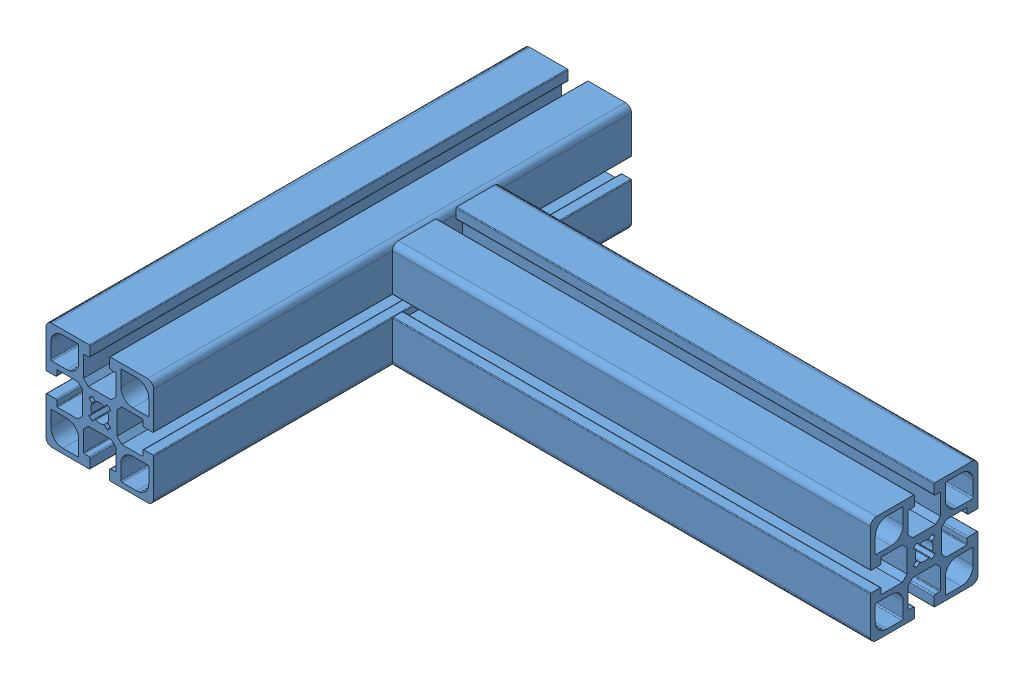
SolidWorks assembly Baugruppe.SLDASM, configuration Standard (file format 6000). Lengths in mm.
Overall size (245 45 200).
2 component instances, 1 part files, 3 mates.
Components (placement in the parent):
- 20.1033_0 Profil 45x45 F-1: 20.1033_0 Profil 45x45 F.SLDPRT [20.1033_0 Profil 45x45 F L=200mm] at origin size (45 45 200)
- 20.1033_0 Profil 45x45 F-2: 20.1033_0 Profil 45x45 F.SLDPRT [20.1033_0 Profil 45x45 F L=200mm] at (122.5 0 -22.5) x (0 0 1) z (-1 0 0) size (45 45 200)
Mates (geometry in assembly coordinates):
- Deckungsgleich1: coincident anti-aligned: plane of 20.1033_0 Profil 45x45 F-1 through (22.5 -20 100) normal (1 0 0); plane of 20.1033_0 Profil 45x45 F-2 through (22.5 -4.4 -44.7) normal (-1 0 0)
- Abstand1: distance = 100 mm aligned: plane of 20.1033_0 Profil 45x45 F-2 through (22.5 4.4 0) normal (0 0 1); plane of 20.1033_0 Profil 45x45 F-1 through (-22.2 -4.4 100) normal (0 0 1)
- Deckungsgleich4: coincident aligned: plane of 20.1033_0 Profil 45x45 F-1 through (4.4 22.5 100) normal (0 1 0); plane of 20.1033_0 Profil 45x45 F-2 through (22.5 22.5 -18.1) normal (0 1 0)
